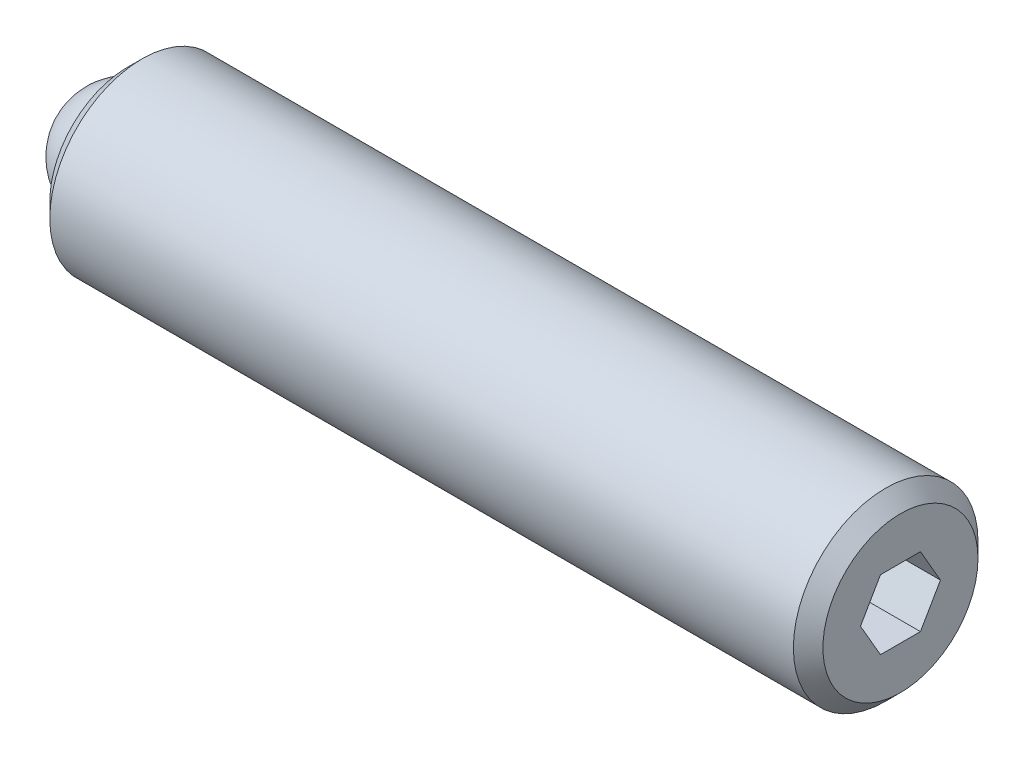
from build123d import *

# Parameters (mm, degrees)
SKETCH2_R           = 3.175
BOSS_EXTRUDE1_DEPTH = 26.590625
CHAMFER1_SIZE       = 0.508
CHAMFER2_SIZE       = 0.508
CUT_EXTRUDE2_DEPTH  = 2.286
SKETCH3_R           = 1.9812
CUT_EXTRUDE3_DEPTH  = 1.984375


with BuildPart() as part:
    # Sketch2 → Boss-Extrude1 (new body)
    with BuildSketch(Plane(origin=(0, 0, 0), x_dir=(0, 0, -1), z_dir=(1, 0, 0))):
        Circle(SKETCH2_R)
    extrude(amount=BOSS_EXTRUDE1_DEPTH)

    # Chamfer1
    chamfer1_edges = [part.edges().sort_by_distance(p)[0] for p in [
        (0, 0, 3.175),
    ]]
    chamfer(chamfer1_edges, length=CHAMFER1_SIZE)

    # Chamfer2
    chamfer2_edges = [part.edges().sort_by_distance(p)[0] for p in [
        (26.590625, 0, 3.175),
    ]]
    chamfer(chamfer2_edges, length=CHAMFER2_SIZE)

    # Sketch4 → Cut-Extrude2 (cut)
    with BuildSketch(Plane(origin=(26.590625, 0, 0), x_dir=(0, 0, -1), z_dir=(1, 0, 0))):
        Polygon((1.374815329, 0), (0.687407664, 1.190625), (-0.687407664, 1.190625), (-1.374815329, 0), (-0.687407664, -1.190625), (0.687407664, -1.190625), align=None)
    extrude(amount=-CUT_EXTRUDE2_DEPTH, mode=Mode.SUBTRACT)

    # Sketch3 → Cut-Extrude3 (cut)
    with BuildSketch(Plane.ZY):
        Circle(SKETCH3_R)
    extrude(amount=-CUT_EXTRUDE3_DEPTH, mode=Mode.SUBTRACT)


with BuildPart() as body_2:
    # Sketch5 → Revolve1 (revolve)
    with BuildSketch(Plane.ZY):
        with BuildLine():
            Line((0, 0), (0, -1.984375))
            ThreePointArc((0, -1.984375), (-1.984375, 0), (0, 1.984375))
            Line((0, 1.984375), (0, 0))
        make_face()
    revolve(axis=Axis((0, 0, 0), (0, 1, 0)))


solid = Compound([part.part, body_2.part])
